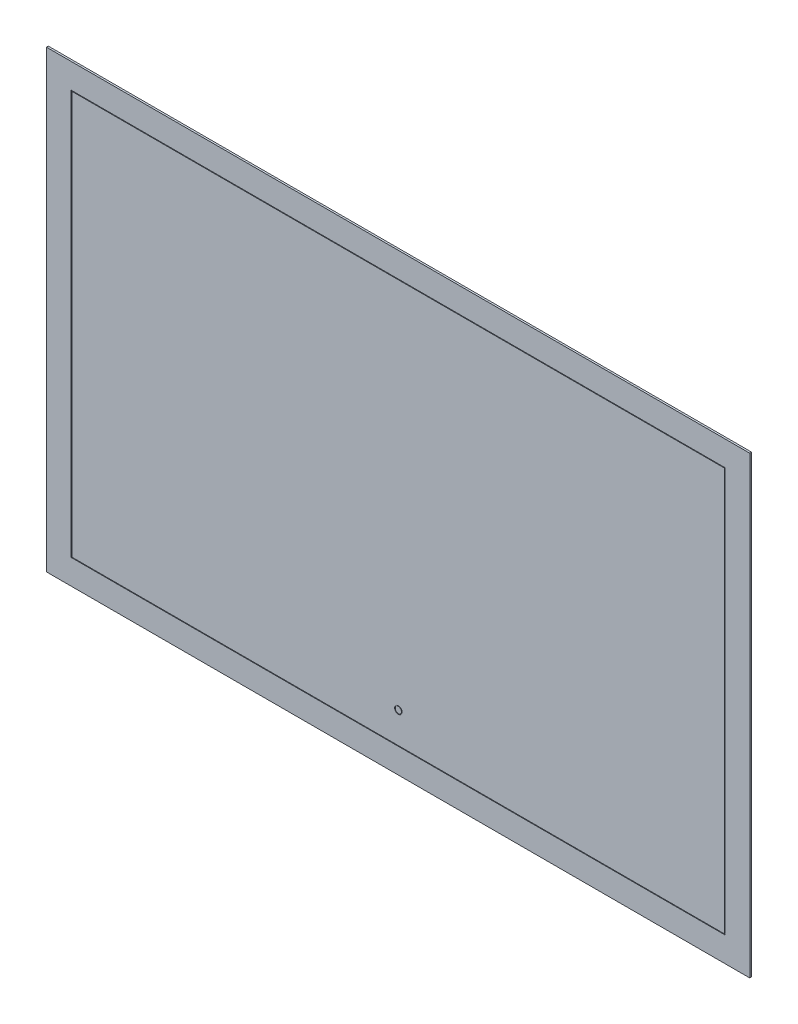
from build123d import *

# Parameters (mm, degrees)
CROQUIS3_W              = 1130
CROQUIS3_H              = 730
CROQUIS3_W_2            = 1050
CROQUIS3_H_2            = 650
CROQUIS3_W_3            = 1048
CROQUIS3_H_3            = 648
SALIENTE_EXTRUIR1_DEPTH = 3
CROQUIS5_W              = 1050
CROQUIS5_H              = 650
CROQUIS5_W_2            = 1048
CROQUIS5_H_2            = 648
CORTAR_EXTRUIR1_DEPTH   = 1
CROQUIS6_W              = 1060
CROQUIS6_H              = 660
SALIENTE_EXTRUIR2_DEPTH = 30
CROQUIS7_W              = 1058
CROQUIS7_H              = 658
CORTAR_EXTRUIR2_DEPTH   = 30
CROQUIS8_R              = 6
CROQUIS8_R_2            = 5
CORTAR_EXTRUIR3_DEPTH   = 1


with BuildPart() as part:
    # Croquis3 → Saliente-Extruir1 (new body)
    # profile 1 of 3: a face of its own
    with BuildSketch(Plane.XY):
        with Locations((565, 365)):
            Rectangle(CROQUIS3_W, CROQUIS3_H)
        with Locations((565, 365)):
            Rectangle(CROQUIS3_W_2, CROQUIS3_H_2, mode=Mode.SUBTRACT)
    # profile 2 of 3: a face of its own
    with BuildSketch(Plane.XY):
        with Locations((565, 365)):
            Rectangle(CROQUIS3_W_2, CROQUIS3_H_2)
        with Locations((565, 365)):
            Rectangle(CROQUIS3_W_3, CROQUIS3_H_3, mode=Mode.SUBTRACT)
    # profile 3 of 3: a face of its own
    with BuildSketch(Plane.XY):
        with Locations((565, 365)):
            Rectangle(CROQUIS3_W_3, CROQUIS3_H_3)
    extrude(amount=SALIENTE_EXTRUIR1_DEPTH)

    # Croquis5 → Cortar-Extruir1 (cut)
    with BuildSketch(Plane.XY.offset(3)):
        with Locations((565, 365)):
            Rectangle(CROQUIS5_W, CROQUIS5_H)
        with Locations((565, 365)):
            Rectangle(CROQUIS5_W_2, CROQUIS5_H_2, mode=Mode.SUBTRACT)
    extrude(amount=-CORTAR_EXTRUIR1_DEPTH, mode=Mode.SUBTRACT)

    # Croquis6 → Saliente-Extruir2 (add)
    with BuildSketch(Plane(origin=(0, 0, 0), x_dir=(-1, 0, 0), z_dir=(0, 0, -1))):
        with Locations((-565, 365)):
            Rectangle(CROQUIS6_W, CROQUIS6_H)
    extrude(amount=SALIENTE_EXTRUIR2_DEPTH)

    # Croquis7 → Cortar-Extruir2 (cut)
    with BuildSketch(Plane(origin=(0, 0, -30), x_dir=(-1, 0, 0), z_dir=(0, 0, -1))):
        with Locations((-565, 365)):
            Rectangle(CROQUIS7_W, CROQUIS7_H)
    extrude(amount=-CORTAR_EXTRUIR2_DEPTH, mode=Mode.SUBTRACT)

    # Croquis8 → Cortar-Extruir3 (cut)
    with BuildSketch(Plane.XY.offset(3)):
        with Locations((565.5, 90.5)):
            Circle(CROQUIS8_R)
        with Locations((565.5, 90.5)):
            Circle(CROQUIS8_R_2, mode=Mode.SUBTRACT)
    extrude(amount=-CORTAR_EXTRUIR3_DEPTH, mode=Mode.SUBTRACT)


solid = part.part
